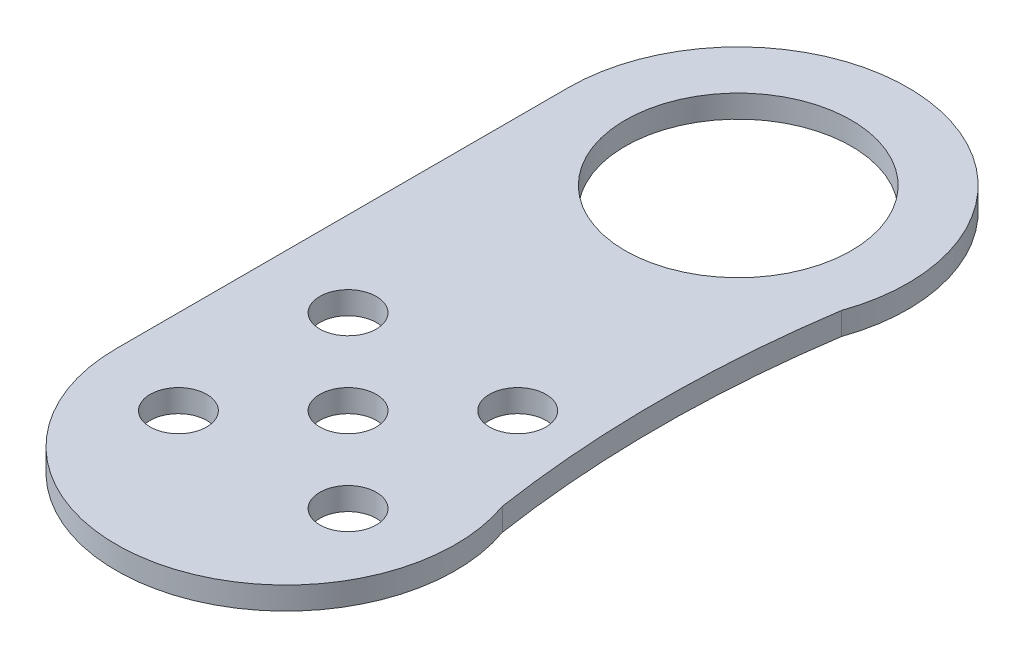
ISO-10303-21;
HEADER;
FILE_DESCRIPTION(('STEP AP214'),'2;1');
FILE_NAME('part.step','',(''),(''),'','','');
FILE_SCHEMA(('AUTOMOTIVE_DESIGN { 1 0 10303 214 1 1 1 1 }'));
ENDSEC;
DATA;
#1=APPLICATION_CONTEXT('core data for automotive mechanical design processes');
#2=APPLICATION_PROTOCOL_DEFINITION('international standard','automotive_design',2000,#1);
#3=PRODUCT_CONTEXT('',#1,'mechanical');
#4=PRODUCT('Part','Part','',(#3));
#5=PRODUCT_RELATED_PRODUCT_CATEGORY('part','',(#4));
#6=PRODUCT_DEFINITION_FORMATION('','',#4);
#7=PRODUCT_DEFINITION_CONTEXT('part definition',#1,'design');
#8=PRODUCT_DEFINITION('design','',#6,#7);
#9=PRODUCT_DEFINITION_SHAPE('','',#8);
#10=(LENGTH_UNIT() NAMED_UNIT(*) SI_UNIT(.MILLI.,.METRE.));
#11=(NAMED_UNIT(*) PLANE_ANGLE_UNIT() SI_UNIT($,.RADIAN.));
#12=(NAMED_UNIT(*) SI_UNIT($,.STERADIAN.) SOLID_ANGLE_UNIT());
#13=UNCERTAINTY_MEASURE_WITH_UNIT(LENGTH_MEASURE(1.E-05),#10,'distance_accuracy_value','');
#14=(GEOMETRIC_REPRESENTATION_CONTEXT(3) GLOBAL_UNCERTAINTY_ASSIGNED_CONTEXT((#13)) GLOBAL_UNIT_ASSIGNED_CONTEXT((#10,
#11,#12)) REPRESENTATION_CONTEXT('',''));
#15=CARTESIAN_POINT('',(0.,0.,0.));
#16=DIRECTION('',(0.,0.,1.));
#17=DIRECTION('',(1.,0.,0.));
#18=AXIS2_PLACEMENT_3D('',#15,#16,#17);
#19=CARTESIAN_POINT('',(98.0107352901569,2.,-20.));
#20=DIRECTION('',(0.,-1.,0.));
#21=DIRECTION('',(0.,0.,-1.));
#22=AXIS2_PLACEMENT_3D('',#19,#20,#21);
#23=CYLINDRICAL_SURFACE('',#22,100.);
#24=CARTESIAN_POINT('',(98.0107352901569,0.,-20.));
#25=DIRECTION('',(0.,1.,0.));
#26=DIRECTION('',(0.,0.,1.));
#27=AXIS2_PLACEMENT_3D('',#24,#25,#26);
#28=CIRCLE('',#27,100.);
#29=CARTESIAN_POINT('',(-0.857864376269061,0.,-35.));
#30=VERTEX_POINT('',#29);
#31=CARTESIAN_POINT('',(-0.857864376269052,0.,-5.));
#32=VERTEX_POINT('',#31);
#33=EDGE_CURVE('E117',#30,#32,#28,.T.);
#34=ORIENTED_EDGE('',*,*,#33,.F.);
#35=DIRECTION('',(0.,-1.,0.));
#36=VECTOR('',#35,1.);
#37=CARTESIAN_POINT('',(-0.857864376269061,2.,-35.));
#38=LINE('',#37,#36);
#39=CARTESIAN_POINT('',(-0.857864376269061,2.,-35.));
#40=VERTEX_POINT('',#39);
#41=EDGE_CURVE('E11',#40,#30,#38,.T.);
#42=ORIENTED_EDGE('',*,*,#41,.F.);
#43=CARTESIAN_POINT('',(98.0107352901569,2.,-20.));
#44=DIRECTION('',(0.,1.,0.));
#45=DIRECTION('',(0.,0.,1.));
#46=AXIS2_PLACEMENT_3D('',#43,#44,#45);
#47=CIRCLE('',#46,100.);
#48=CARTESIAN_POINT('',(-0.857864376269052,2.,-5.));
#49=VERTEX_POINT('',#48);
#50=EDGE_CURVE('E107',#40,#49,#47,.T.);
#51=ORIENTED_EDGE('',*,*,#50,.T.);
#52=DIRECTION('',(0.,-1.,0.));
#53=VECTOR('',#52,1.);
#54=CARTESIAN_POINT('',(-0.857864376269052,2.,-5.));
#55=LINE('',#54,#53);
#56=EDGE_CURVE('E86',#49,#32,#55,.T.);
#57=ORIENTED_EDGE('',*,*,#56,.T.);
#58=EDGE_LOOP('',(#34,#42,#51,#57));
#59=FACE_BOUND('',#58,.T.);
#60=ADVANCED_FACE('F47',(#59),#23,.F.);
#61=CARTESIAN_POINT('',(-15.,2.,-40.));
#62=DIRECTION('',(0.,-1.,0.));
#63=DIRECTION('',(0.,0.,-1.));
#64=AXIS2_PLACEMENT_3D('',#61,#62,#63);
#65=CYLINDRICAL_SURFACE('',#64,15.);
#66=CARTESIAN_POINT('',(-15.,0.,-40.));
#67=DIRECTION('',(0.,1.,0.));
#68=DIRECTION('',(0.,0.,1.));
#69=AXIS2_PLACEMENT_3D('',#66,#67,#68);
#70=CIRCLE('',#69,15.);
#71=CARTESIAN_POINT('',(-30.,0.,-40.));
#72=VERTEX_POINT('',#71);
#73=EDGE_CURVE('E99',#72,#30,#70,.F.);
#74=ORIENTED_EDGE('',*,*,#73,.F.);
#75=DIRECTION('',(0.,-1.,0.));
#76=VECTOR('',#75,1.);
#77=CARTESIAN_POINT('',(-30.,2.,-40.));
#78=LINE('',#77,#76);
#79=CARTESIAN_POINT('',(-30.,2.,-40.));
#80=VERTEX_POINT('',#79);
#81=EDGE_CURVE('E56',#80,#72,#78,.T.);
#82=ORIENTED_EDGE('',*,*,#81,.F.);
#83=CARTESIAN_POINT('',(-15.,2.,-40.));
#84=DIRECTION('',(0.,1.,0.));
#85=DIRECTION('',(0.,0.,1.));
#86=AXIS2_PLACEMENT_3D('',#83,#84,#85);
#87=CIRCLE('',#86,15.);
#88=EDGE_CURVE('E97',#80,#40,#87,.F.);
#89=ORIENTED_EDGE('',*,*,#88,.T.);
#90=ORIENTED_EDGE('',*,*,#41,.T.);
#91=EDGE_LOOP('',(#74,#82,#89,#90));
#92=FACE_BOUND('',#91,.T.);
#93=ADVANCED_FACE('F95',(#92),#65,.T.);
#94=CARTESIAN_POINT('',(-30.,2.,0.));
#95=DIRECTION('',(1.,0.,0.));
#96=DIRECTION('',(0.,0.,-1.));
#97=AXIS2_PLACEMENT_3D('',#94,#95,#96);
#98=PLANE('',#97);
#99=DIRECTION('',(0.,0.,1.));
#100=VECTOR('',#99,1.);
#101=CARTESIAN_POINT('',(-30.,0.,0.));
#102=LINE('',#101,#100);
#103=CARTESIAN_POINT('',(-30.,0.,0.));
#104=VERTEX_POINT('',#103);
#105=EDGE_CURVE('E79',#72,#104,#102,.T.);
#106=ORIENTED_EDGE('',*,*,#105,.T.);
#107=DIRECTION('',(0.,-1.,0.));
#108=VECTOR('',#107,1.);
#109=CARTESIAN_POINT('',(-30.,2.,0.));
#110=LINE('',#109,#108);
#111=CARTESIAN_POINT('',(-30.,2.,0.));
#112=VERTEX_POINT('',#111);
#113=EDGE_CURVE('E101',#112,#104,#110,.T.);
#114=ORIENTED_EDGE('',*,*,#113,.F.);
#115=DIRECTION('',(0.,0.,1.));
#116=VECTOR('',#115,1.);
#117=CARTESIAN_POINT('',(-30.,2.,0.));
#118=LINE('',#117,#116);
#119=EDGE_CURVE('E102',#80,#112,#118,.T.);
#120=ORIENTED_EDGE('',*,*,#119,.F.);
#121=ORIENTED_EDGE('',*,*,#81,.T.);
#122=EDGE_LOOP('',(#106,#114,#120,#121));
#123=FACE_BOUND('',#122,.T.);
#124=ADVANCED_FACE('F103',(#123),#98,.F.);
#125=CARTESIAN_POINT('',(-15.,2.,0.));
#126=DIRECTION('',(0.,-1.,0.));
#127=DIRECTION('',(0.,0.,-1.));
#128=AXIS2_PLACEMENT_3D('',#125,#126,#127);
#129=CYLINDRICAL_SURFACE('',#128,15.);
#130=CARTESIAN_POINT('',(-15.,0.,0.));
#131=DIRECTION('',(0.,1.,0.));
#132=DIRECTION('',(0.,0.,1.));
#133=AXIS2_PLACEMENT_3D('',#130,#131,#132);
#134=CIRCLE('',#133,15.);
#135=EDGE_CURVE('E111',#104,#32,#134,.T.);
#136=ORIENTED_EDGE('',*,*,#135,.T.);
#137=ORIENTED_EDGE('',*,*,#56,.F.);
#138=CARTESIAN_POINT('',(-15.,2.,0.));
#139=DIRECTION('',(0.,1.,0.));
#140=DIRECTION('',(0.,0.,1.));
#141=AXIS2_PLACEMENT_3D('',#138,#139,#140);
#142=CIRCLE('',#141,15.);
#143=EDGE_CURVE('E64',#112,#49,#142,.T.);
#144=ORIENTED_EDGE('',*,*,#143,.F.);
#145=ORIENTED_EDGE('',*,*,#113,.T.);
#146=EDGE_LOOP('',(#136,#137,#144,#145));
#147=FACE_BOUND('',#146,.T.);
#148=ADVANCED_FACE('F133',(#147),#129,.T.);
#149=CARTESIAN_POINT('',(0.,2.,0.));
#150=DIRECTION('',(0.,1.,0.));
#151=DIRECTION('',(0.,0.,1.));
#152=AXIS2_PLACEMENT_3D('',#149,#150,#151);
#153=PLANE('',#152);
#154=CARTESIAN_POINT('',(-15.,2.,-40.));
#155=DIRECTION('',(0.,1.,0.));
#156=DIRECTION('',(0.,0.,1.));
#157=AXIS2_PLACEMENT_3D('',#154,#155,#156);
#158=CIRCLE('',#157,10.);
#159=CARTESIAN_POINT('',(-15.,2.,-30.));
#160=VERTEX_POINT('',#159);
#161=EDGE_CURVE('E121',#160,#160,#158,.T.);
#162=ORIENTED_EDGE('',*,*,#161,.F.);
#163=EDGE_LOOP('',(#162));
#164=FACE_BOUND('',#163,.T.);
#165=CARTESIAN_POINT('',(-22.5,2.,2.));
#166=DIRECTION('',(0.,1.,0.));
#167=DIRECTION('',(0.,0.,1.));
#168=AXIS2_PLACEMENT_3D('',#165,#166,#167);
#169=CIRCLE('',#168,2.5);
#170=CARTESIAN_POINT('',(-22.5,2.,4.5));
#171=VERTEX_POINT('',#170);
#172=EDGE_CURVE('E223',#171,#171,#169,.T.);
#173=ORIENTED_EDGE('',*,*,#172,.F.);
#174=EDGE_LOOP('',(#173));
#175=FACE_BOUND('',#174,.T.);
#176=CARTESIAN_POINT('',(-7.50000000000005,2.,2.));
#177=DIRECTION('',(0.,1.,0.));
#178=DIRECTION('',(0.,0.,1.));
#179=AXIS2_PLACEMENT_3D('',#176,#177,#178);
#180=CIRCLE('',#179,2.5);
#181=CARTESIAN_POINT('',(-7.50000000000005,2.,4.5));
#182=VERTEX_POINT('',#181);
#183=EDGE_CURVE('E219',#182,#182,#180,.T.);
#184=ORIENTED_EDGE('',*,*,#183,.F.);
#185=EDGE_LOOP('',(#184));
#186=FACE_BOUND('',#185,.T.);
#187=CARTESIAN_POINT('',(-15.0000000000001,2.,-5.5));
#188=DIRECTION('',(0.,1.,0.));
#189=DIRECTION('',(0.,0.,1.));
#190=AXIS2_PLACEMENT_3D('',#187,#188,#189);
#191=CIRCLE('',#190,2.5);
#192=CARTESIAN_POINT('',(-15.0000000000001,2.,-3.));
#193=VERTEX_POINT('',#192);
#194=EDGE_CURVE('E215',#193,#193,#191,.T.);
#195=ORIENTED_EDGE('',*,*,#194,.F.);
#196=EDGE_LOOP('',(#195));
#197=FACE_BOUND('',#196,.T.);
#198=CARTESIAN_POINT('',(-7.50000000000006,2.,-13.));
#199=DIRECTION('',(0.,1.,0.));
#200=DIRECTION('',(0.,0.,1.));
#201=AXIS2_PLACEMENT_3D('',#198,#199,#200);
#202=CIRCLE('',#201,2.5);
#203=CARTESIAN_POINT('',(-7.50000000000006,2.,-10.5));
#204=VERTEX_POINT('',#203);
#205=EDGE_CURVE('E191',#204,#204,#202,.T.);
#206=ORIENTED_EDGE('',*,*,#205,.F.);
#207=EDGE_LOOP('',(#206));
#208=FACE_BOUND('',#207,.T.);
#209=CARTESIAN_POINT('',(-22.5000000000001,2.,-13.));
#210=DIRECTION('',(0.,1.,0.));
#211=DIRECTION('',(0.,0.,1.));
#212=AXIS2_PLACEMENT_3D('',#209,#210,#211);
#213=CIRCLE('',#212,2.5);
#214=CARTESIAN_POINT('',(-22.5000000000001,2.,-10.5));
#215=VERTEX_POINT('',#214);
#216=EDGE_CURVE('E185',#215,#215,#213,.T.);
#217=ORIENTED_EDGE('',*,*,#216,.F.);
#218=EDGE_LOOP('',(#217));
#219=FACE_BOUND('',#218,.T.);
#220=ORIENTED_EDGE('',*,*,#50,.F.);
#221=ORIENTED_EDGE('',*,*,#88,.F.);
#222=ORIENTED_EDGE('',*,*,#119,.T.);
#223=ORIENTED_EDGE('',*,*,#143,.T.);
#224=EDGE_LOOP('',(#220,#221,#222,#223));
#225=FACE_BOUND('',#224,.T.);
#226=ADVANCED_FACE('F106',(#164,#175,#186,#197,#208,#219,#225),#153,.T.);
#227=CARTESIAN_POINT('',(0.,0.,0.));
#228=DIRECTION('',(0.,1.,0.));
#229=DIRECTION('',(0.,0.,1.));
#230=AXIS2_PLACEMENT_3D('',#227,#228,#229);
#231=PLANE('',#230);
#232=CARTESIAN_POINT('',(-15.,0.,-40.));
#233=DIRECTION('',(0.,1.,0.));
#234=DIRECTION('',(0.,0.,1.));
#235=AXIS2_PLACEMENT_3D('',#232,#233,#234);
#236=CIRCLE('',#235,10.);
#237=CARTESIAN_POINT('',(-15.,0.,-30.));
#238=VERTEX_POINT('',#237);
#239=EDGE_CURVE('E183',#238,#238,#236,.T.);
#240=ORIENTED_EDGE('',*,*,#239,.T.);
#241=EDGE_LOOP('',(#240));
#242=FACE_BOUND('',#241,.T.);
#243=CARTESIAN_POINT('',(-22.5,0.,2.));
#244=DIRECTION('',(0.,1.,0.));
#245=DIRECTION('',(0.,0.,1.));
#246=AXIS2_PLACEMENT_3D('',#243,#244,#245);
#247=CIRCLE('',#246,2.5);
#248=CARTESIAN_POINT('',(-22.5,0.,4.5));
#249=VERTEX_POINT('',#248);
#250=EDGE_CURVE('E197',#249,#249,#247,.T.);
#251=ORIENTED_EDGE('',*,*,#250,.T.);
#252=EDGE_LOOP('',(#251));
#253=FACE_BOUND('',#252,.T.);
#254=CARTESIAN_POINT('',(-7.50000000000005,0.,2.));
#255=DIRECTION('',(0.,1.,0.));
#256=DIRECTION('',(0.,0.,1.));
#257=AXIS2_PLACEMENT_3D('',#254,#255,#256);
#258=CIRCLE('',#257,2.5);
#259=CARTESIAN_POINT('',(-7.50000000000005,0.,4.5));
#260=VERTEX_POINT('',#259);
#261=EDGE_CURVE('E200',#260,#260,#258,.T.);
#262=ORIENTED_EDGE('',*,*,#261,.T.);
#263=EDGE_LOOP('',(#262));
#264=FACE_BOUND('',#263,.T.);
#265=CARTESIAN_POINT('',(-15.0000000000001,0.,-5.5));
#266=DIRECTION('',(0.,1.,0.));
#267=DIRECTION('',(0.,0.,1.));
#268=AXIS2_PLACEMENT_3D('',#265,#266,#267);
#269=CIRCLE('',#268,2.5);
#270=CARTESIAN_POINT('',(-15.0000000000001,0.,-3.));
#271=VERTEX_POINT('',#270);
#272=EDGE_CURVE('E205',#271,#271,#269,.T.);
#273=ORIENTED_EDGE('',*,*,#272,.T.);
#274=EDGE_LOOP('',(#273));
#275=FACE_BOUND('',#274,.T.);
#276=CARTESIAN_POINT('',(-7.50000000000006,0.,-13.));
#277=DIRECTION('',(0.,1.,0.));
#278=DIRECTION('',(0.,0.,1.));
#279=AXIS2_PLACEMENT_3D('',#276,#277,#278);
#280=CIRCLE('',#279,2.5);
#281=CARTESIAN_POINT('',(-7.50000000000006,0.,-10.5));
#282=VERTEX_POINT('',#281);
#283=EDGE_CURVE('E194',#282,#282,#280,.T.);
#284=ORIENTED_EDGE('',*,*,#283,.T.);
#285=EDGE_LOOP('',(#284));
#286=FACE_BOUND('',#285,.T.);
#287=CARTESIAN_POINT('',(-22.5000000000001,0.,-13.));
#288=DIRECTION('',(0.,1.,0.));
#289=DIRECTION('',(0.,0.,1.));
#290=AXIS2_PLACEMENT_3D('',#287,#288,#289);
#291=CIRCLE('',#290,2.5);
#292=CARTESIAN_POINT('',(-22.5000000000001,0.,-10.5));
#293=VERTEX_POINT('',#292);
#294=EDGE_CURVE('E186',#293,#293,#291,.T.);
#295=ORIENTED_EDGE('',*,*,#294,.T.);
#296=EDGE_LOOP('',(#295));
#297=FACE_BOUND('',#296,.T.);
#298=ORIENTED_EDGE('',*,*,#33,.T.);
#299=ORIENTED_EDGE('',*,*,#135,.F.);
#300=ORIENTED_EDGE('',*,*,#105,.F.);
#301=ORIENTED_EDGE('',*,*,#73,.T.);
#302=EDGE_LOOP('',(#298,#299,#300,#301));
#303=FACE_BOUND('',#302,.T.);
#304=ADVANCED_FACE('F135',(#242,#253,#264,#275,#286,#297,#303),#231,.F.);
#305=CARTESIAN_POINT('',(-22.5000000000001,0.,-13.));
#306=DIRECTION('',(0.,1.,0.));
#307=DIRECTION('',(0.,0.,1.));
#308=AXIS2_PLACEMENT_3D('',#305,#306,#307);
#309=CYLINDRICAL_SURFACE('',#308,2.5);
#310=ORIENTED_EDGE('',*,*,#216,.T.);
#311=EDGE_LOOP('',(#310));
#312=FACE_BOUND('',#311,.T.);
#313=ORIENTED_EDGE('',*,*,#294,.F.);
#314=EDGE_LOOP('',(#313));
#315=FACE_BOUND('',#314,.T.);
#316=ADVANCED_FACE('F149',(#312,#315),#309,.F.);
#317=CARTESIAN_POINT('',(-7.50000000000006,0.,-13.));
#318=DIRECTION('',(0.,1.,0.));
#319=DIRECTION('',(0.,0.,1.));
#320=AXIS2_PLACEMENT_3D('',#317,#318,#319);
#321=CYLINDRICAL_SURFACE('',#320,2.5);
#322=ORIENTED_EDGE('',*,*,#205,.T.);
#323=EDGE_LOOP('',(#322));
#324=FACE_BOUND('',#323,.T.);
#325=ORIENTED_EDGE('',*,*,#283,.F.);
#326=EDGE_LOOP('',(#325));
#327=FACE_BOUND('',#326,.T.);
#328=ADVANCED_FACE('F162',(#324,#327),#321,.F.);
#329=CARTESIAN_POINT('',(-15.0000000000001,0.,-5.5));
#330=DIRECTION('',(0.,1.,0.));
#331=DIRECTION('',(0.,0.,1.));
#332=AXIS2_PLACEMENT_3D('',#329,#330,#331);
#333=CYLINDRICAL_SURFACE('',#332,2.5);
#334=ORIENTED_EDGE('',*,*,#194,.T.);
#335=EDGE_LOOP('',(#334));
#336=FACE_BOUND('',#335,.T.);
#337=ORIENTED_EDGE('',*,*,#272,.F.);
#338=EDGE_LOOP('',(#337));
#339=FACE_BOUND('',#338,.T.);
#340=ADVANCED_FACE('F158',(#336,#339),#333,.F.);
#341=CARTESIAN_POINT('',(-7.50000000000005,0.,2.));
#342=DIRECTION('',(0.,1.,0.));
#343=DIRECTION('',(0.,0.,1.));
#344=AXIS2_PLACEMENT_3D('',#341,#342,#343);
#345=CYLINDRICAL_SURFACE('',#344,2.5);
#346=ORIENTED_EDGE('',*,*,#183,.T.);
#347=EDGE_LOOP('',(#346));
#348=FACE_BOUND('',#347,.T.);
#349=ORIENTED_EDGE('',*,*,#261,.F.);
#350=EDGE_LOOP('',(#349));
#351=FACE_BOUND('',#350,.T.);
#352=ADVANCED_FACE('F154',(#348,#351),#345,.F.);
#353=CARTESIAN_POINT('',(-22.5,0.,2.));
#354=DIRECTION('',(0.,1.,0.));
#355=DIRECTION('',(0.,0.,1.));
#356=AXIS2_PLACEMENT_3D('',#353,#354,#355);
#357=CYLINDRICAL_SURFACE('',#356,2.5);
#358=ORIENTED_EDGE('',*,*,#172,.T.);
#359=EDGE_LOOP('',(#358));
#360=FACE_BOUND('',#359,.T.);
#361=ORIENTED_EDGE('',*,*,#250,.F.);
#362=EDGE_LOOP('',(#361));
#363=FACE_BOUND('',#362,.T.);
#364=ADVANCED_FACE('F157',(#360,#363),#357,.F.);
#365=CARTESIAN_POINT('',(-15.,0.,-40.));
#366=DIRECTION('',(0.,1.,0.));
#367=DIRECTION('',(0.,0.,1.));
#368=AXIS2_PLACEMENT_3D('',#365,#366,#367);
#369=CYLINDRICAL_SURFACE('',#368,10.);
#370=ORIENTED_EDGE('',*,*,#161,.T.);
#371=EDGE_LOOP('',(#370));
#372=FACE_BOUND('',#371,.T.);
#373=ORIENTED_EDGE('',*,*,#239,.F.);
#374=EDGE_LOOP('',(#373));
#375=FACE_BOUND('',#374,.T.);
#376=ADVANCED_FACE('F172',(#372,#375),#369,.F.);
#377=CLOSED_SHELL('',(#60,#93,#124,#148,#226,#304,#316,#328,#340,#352,#364,#376));
#378=MANIFOLD_SOLID_BREP('B2',#377);
#379=ADVANCED_BREP_SHAPE_REPRESENTATION('',(#18,#378),#14);
#380=SHAPE_DEFINITION_REPRESENTATION(#9,#379);
ENDSEC;
END-ISO-10303-21;
